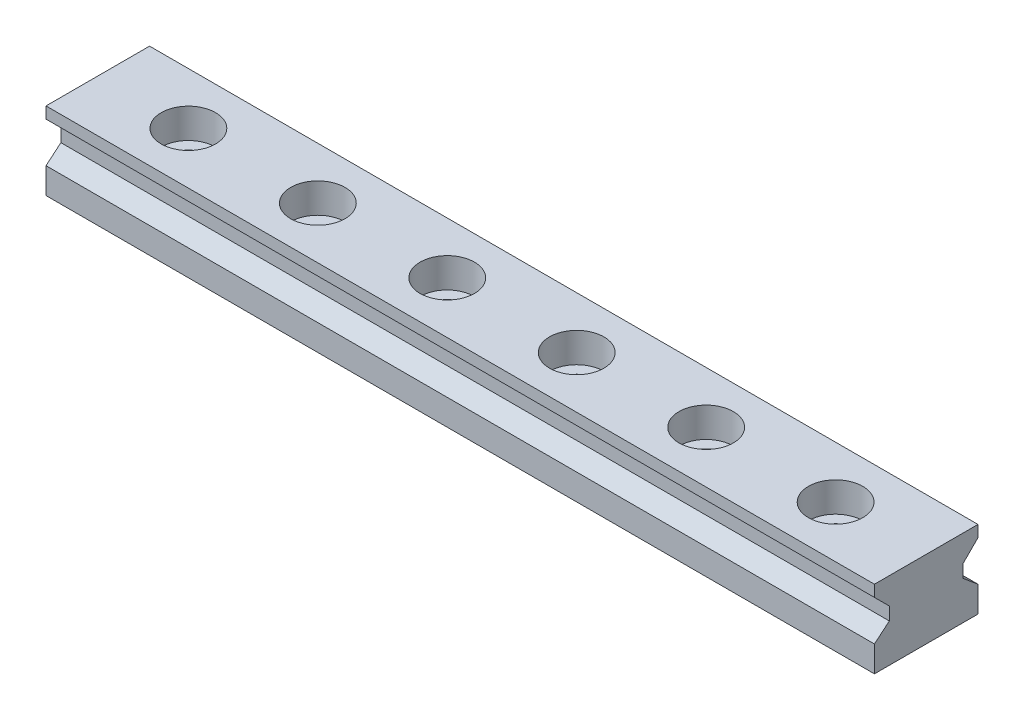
ISO-10303-21;
HEADER;
FILE_DESCRIPTION(('STEP AP214'),'2;1');
FILE_NAME('part.step','',(''),(''),'','','');
FILE_SCHEMA(('AUTOMOTIVE_DESIGN { 1 0 10303 214 1 1 1 1 }'));
ENDSEC;
DATA;
#1=APPLICATION_CONTEXT('core data for automotive mechanical design processes');
#2=APPLICATION_PROTOCOL_DEFINITION('international standard','automotive_design',2000,#1);
#3=PRODUCT_CONTEXT('',#1,'mechanical');
#4=PRODUCT('Part','Part','',(#3));
#5=PRODUCT_RELATED_PRODUCT_CATEGORY('part','',(#4));
#6=PRODUCT_DEFINITION_FORMATION('','',#4);
#7=PRODUCT_DEFINITION_CONTEXT('part definition',#1,'design');
#8=PRODUCT_DEFINITION('design','',#6,#7);
#9=PRODUCT_DEFINITION_SHAPE('','',#8);
#10=(LENGTH_UNIT() NAMED_UNIT(*) SI_UNIT(.MILLI.,.METRE.));
#11=(NAMED_UNIT(*) PLANE_ANGLE_UNIT() SI_UNIT($,.RADIAN.));
#12=(NAMED_UNIT(*) SI_UNIT($,.STERADIAN.) SOLID_ANGLE_UNIT());
#13=UNCERTAINTY_MEASURE_WITH_UNIT(LENGTH_MEASURE(1.E-05),#10,'distance_accuracy_value','');
#14=(GEOMETRIC_REPRESENTATION_CONTEXT(3) GLOBAL_UNCERTAINTY_ASSIGNED_CONTEXT((#13)) GLOBAL_UNIT_ASSIGNED_CONTEXT((#10,
#11,#12)) REPRESENTATION_CONTEXT('',''));
#15=CARTESIAN_POINT('',(0.,0.,0.));
#16=DIRECTION('',(0.,0.,1.));
#17=DIRECTION('',(1.,0.,0.));
#18=AXIS2_PLACEMENT_3D('',#15,#16,#17);
#19=CARTESIAN_POINT('',(-32.,5.114964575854,4.));
#20=DIRECTION('',(0.,-0.707106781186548,0.707106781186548));
#21=DIRECTION('',(0.,-0.707106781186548,-0.707106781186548));
#22=AXIS2_PLACEMENT_3D('',#19,#20,#21);
#23=PLANE('',#22);
#24=DIRECTION('',(1.,0.,0.));
#25=VECTOR('',#24,1.);
#26=CARTESIAN_POINT('',(-32.,5.114964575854,4.));
#27=LINE('',#26,#25);
#28=CARTESIAN_POINT('',(-32.,5.114964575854,4.));
#29=VERTEX_POINT('',#28);
#30=CARTESIAN_POINT('',(32.,5.114964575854,4.));
#31=VERTEX_POINT('',#30);
#32=EDGE_CURVE('E245',#29,#31,#27,.T.);
#33=ORIENTED_EDGE('',*,*,#32,.F.);
#34=DIRECTION('',(0.,-0.707106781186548,-0.707106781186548));
#35=VECTOR('',#34,1.);
#36=CARTESIAN_POINT('',(-32.,5.114964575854,4.));
#37=LINE('',#36,#35);
#38=CARTESIAN_POINT('',(-32.,3.964964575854,2.85));
#39=VERTEX_POINT('',#38);
#40=EDGE_CURVE('E117',#29,#39,#37,.T.);
#41=ORIENTED_EDGE('',*,*,#40,.T.);
#42=DIRECTION('',(1.,0.,0.));
#43=VECTOR('',#42,1.);
#44=CARTESIAN_POINT('',(-32.,3.964964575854,2.85));
#45=LINE('',#44,#43);
#46=CARTESIAN_POINT('',(32.,3.964964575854,2.85));
#47=VERTEX_POINT('',#46);
#48=EDGE_CURVE('E250',#47,#39,#45,.F.);
#49=ORIENTED_EDGE('',*,*,#48,.F.);
#50=DIRECTION('',(0.,-0.707106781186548,-0.707106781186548));
#51=VECTOR('',#50,1.);
#52=CARTESIAN_POINT('',(32.,5.114964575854,4.));
#53=LINE('',#52,#51);
#54=EDGE_CURVE('E136',#47,#31,#53,.F.);
#55=ORIENTED_EDGE('',*,*,#54,.T.);
#56=EDGE_LOOP('',(#33,#41,#49,#55));
#57=FACE_BOUND('',#56,.T.);
#58=ADVANCED_FACE('F16',(#57),#23,.T.);
#59=CARTESIAN_POINT('',(-32.,3.964964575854,-2.85));
#60=DIRECTION('',(0.,-0.707106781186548,-0.707106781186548));
#61=DIRECTION('',(0.,0.707106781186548,-0.707106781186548));
#62=AXIS2_PLACEMENT_3D('',#59,#60,#61);
#63=PLANE('',#62);
#64=DIRECTION('',(-1.,0.,0.));
#65=VECTOR('',#64,1.);
#66=CARTESIAN_POINT('',(-32.,3.964964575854,-2.85));
#67=LINE('',#66,#65);
#68=CARTESIAN_POINT('',(-32.,3.964964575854,-2.85));
#69=VERTEX_POINT('',#68);
#70=CARTESIAN_POINT('',(32.,3.964964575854,-2.85));
#71=VERTEX_POINT('',#70);
#72=EDGE_CURVE('E111',#69,#71,#67,.F.);
#73=ORIENTED_EDGE('',*,*,#72,.F.);
#74=DIRECTION('',(0.,0.707106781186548,-0.707106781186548));
#75=VECTOR('',#74,1.);
#76=CARTESIAN_POINT('',(-32.,3.964964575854,-2.85));
#77=LINE('',#76,#75);
#78=CARTESIAN_POINT('',(-32.,5.114964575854,-4.));
#79=VERTEX_POINT('',#78);
#80=EDGE_CURVE('E102',#69,#79,#77,.T.);
#81=ORIENTED_EDGE('',*,*,#80,.T.);
#82=DIRECTION('',(-1.,0.,0.));
#83=VECTOR('',#82,1.);
#84=CARTESIAN_POINT('',(-32.,5.114964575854,-4.));
#85=LINE('',#84,#83);
#86=CARTESIAN_POINT('',(32.,5.114964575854,-4.));
#87=VERTEX_POINT('',#86);
#88=EDGE_CURVE('E114',#87,#79,#85,.T.);
#89=ORIENTED_EDGE('',*,*,#88,.F.);
#90=DIRECTION('',(0.,0.707106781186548,-0.707106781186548));
#91=VECTOR('',#90,1.);
#92=CARTESIAN_POINT('',(32.,3.964964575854,-2.85));
#93=LINE('',#92,#91);
#94=EDGE_CURVE('E107',#87,#71,#93,.F.);
#95=ORIENTED_EDGE('',*,*,#94,.T.);
#96=EDGE_LOOP('',(#73,#81,#89,#95));
#97=FACE_BOUND('',#96,.T.);
#98=ADVANCED_FACE('F109',(#97),#63,.T.);
#99=CARTESIAN_POINT('',(-32.,2.964964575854,-2.85));
#100=DIRECTION('',(0.,0.,-1.));
#101=DIRECTION('',(-1.,0.,0.));
#102=AXIS2_PLACEMENT_3D('',#99,#100,#101);
#103=PLANE('',#102);
#104=DIRECTION('',(1.,0.,0.));
#105=VECTOR('',#104,1.);
#106=CARTESIAN_POINT('',(-32.,2.96496457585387,-2.84999999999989));
#107=LINE('',#106,#105);
#108=CARTESIAN_POINT('',(-32.,2.96496457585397,-2.84999999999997));
#109=VERTEX_POINT('',#108);
#110=CARTESIAN_POINT('',(32.,2.96496457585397,-2.84999999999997));
#111=VERTEX_POINT('',#110);
#112=EDGE_CURVE('E233',#109,#111,#107,.T.);
#113=ORIENTED_EDGE('',*,*,#112,.F.);
#114=DIRECTION('',(0.,1.,0.));
#115=VECTOR('',#114,1.);
#116=CARTESIAN_POINT('',(-32.,2.964964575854,-2.85));
#117=LINE('',#116,#115);
#118=EDGE_CURVE('E128',#109,#69,#117,.T.);
#119=ORIENTED_EDGE('',*,*,#118,.T.);
#120=ORIENTED_EDGE('',*,*,#72,.T.);
#121=DIRECTION('',(0.,1.,0.));
#122=VECTOR('',#121,1.);
#123=CARTESIAN_POINT('',(32.,2.964964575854,-2.85));
#124=LINE('',#123,#122);
#125=EDGE_CURVE('E120',#71,#111,#124,.F.);
#126=ORIENTED_EDGE('',*,*,#125,.T.);
#127=EDGE_LOOP('',(#113,#119,#120,#126));
#128=FACE_BOUND('',#127,.T.);
#129=ADVANCED_FACE('F130',(#128),#103,.T.);
#130=CARTESIAN_POINT('',(-32.,3.964964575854,2.85));
#131=DIRECTION('',(0.,0.,1.));
#132=DIRECTION('',(1.,0.,0.));
#133=AXIS2_PLACEMENT_3D('',#130,#131,#132);
#134=PLANE('',#133);
#135=ORIENTED_EDGE('',*,*,#48,.T.);
#136=DIRECTION('',(0.,1.,0.));
#137=VECTOR('',#136,1.);
#138=CARTESIAN_POINT('',(-32.,3.964964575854,2.85));
#139=LINE('',#138,#137);
#140=CARTESIAN_POINT('',(-32.,2.964964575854,2.85));
#141=VERTEX_POINT('',#140);
#142=EDGE_CURVE('E248',#39,#141,#139,.F.);
#143=ORIENTED_EDGE('',*,*,#142,.T.);
#144=DIRECTION('',(1.,0.,0.));
#145=VECTOR('',#144,1.);
#146=CARTESIAN_POINT('',(-32.,2.964964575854,2.85));
#147=LINE('',#146,#145);
#148=CARTESIAN_POINT('',(32.,2.964964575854,2.85));
#149=VERTEX_POINT('',#148);
#150=EDGE_CURVE('E226',#149,#141,#147,.F.);
#151=ORIENTED_EDGE('',*,*,#150,.F.);
#152=DIRECTION('',(0.,1.,0.));
#153=VECTOR('',#152,1.);
#154=CARTESIAN_POINT('',(32.,3.964964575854,2.85));
#155=LINE('',#154,#153);
#156=EDGE_CURVE('E253',#149,#47,#155,.T.);
#157=ORIENTED_EDGE('',*,*,#156,.T.);
#158=EDGE_LOOP('',(#135,#143,#151,#157));
#159=FACE_BOUND('',#158,.T.);
#160=ADVANCED_FACE('F257',(#159),#134,.T.);
#161=CARTESIAN_POINT('',(-32.,6.,4.));
#162=DIRECTION('',(0.,0.,1.));
#163=DIRECTION('',(1.,0.,0.));
#164=AXIS2_PLACEMENT_3D('',#161,#162,#163);
#165=PLANE('',#164);
#166=DIRECTION('',(1.,0.,0.));
#167=VECTOR('',#166,1.);
#168=CARTESIAN_POINT('',(-32.,6.,4.));
#169=LINE('',#168,#167);
#170=CARTESIAN_POINT('',(-32.,6.,4.));
#171=VERTEX_POINT('',#170);
#172=CARTESIAN_POINT('',(32.,6.,4.));
#173=VERTEX_POINT('',#172);
#174=EDGE_CURVE('E212',#171,#173,#169,.T.);
#175=ORIENTED_EDGE('',*,*,#174,.F.);
#176=DIRECTION('',(0.,1.,0.));
#177=VECTOR('',#176,1.);
#178=CARTESIAN_POINT('',(-32.,6.,4.));
#179=LINE('',#178,#177);
#180=EDGE_CURVE('E240',#171,#29,#179,.F.);
#181=ORIENTED_EDGE('',*,*,#180,.T.);
#182=ORIENTED_EDGE('',*,*,#32,.T.);
#183=DIRECTION('',(0.,1.,0.));
#184=VECTOR('',#183,1.);
#185=CARTESIAN_POINT('',(32.,6.,4.));
#186=LINE('',#185,#184);
#187=EDGE_CURVE('E243',#31,#173,#186,.T.);
#188=ORIENTED_EDGE('',*,*,#187,.T.);
#189=EDGE_LOOP('',(#175,#181,#182,#188));
#190=FACE_BOUND('',#189,.T.);
#191=ADVANCED_FACE('F370',(#190),#165,.T.);
#192=CARTESIAN_POINT('',(-32.,5.114964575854,-4.));
#193=DIRECTION('',(0.,0.,-1.));
#194=DIRECTION('',(-1.,0.,0.));
#195=AXIS2_PLACEMENT_3D('',#192,#193,#194);
#196=PLANE('',#195);
#197=ORIENTED_EDGE('',*,*,#88,.T.);
#198=DIRECTION('',(0.,1.,0.));
#199=VECTOR('',#198,1.);
#200=CARTESIAN_POINT('',(-32.,5.114964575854,-4.));
#201=LINE('',#200,#199);
#202=CARTESIAN_POINT('',(-32.,6.,-4.));
#203=VERTEX_POINT('',#202);
#204=EDGE_CURVE('E235',#79,#203,#201,.T.);
#205=ORIENTED_EDGE('',*,*,#204,.T.);
#206=DIRECTION('',(1.,0.,0.));
#207=VECTOR('',#206,1.);
#208=CARTESIAN_POINT('',(-32.,6.,-4.));
#209=LINE('',#208,#207);
#210=CARTESIAN_POINT('',(32.,6.,-4.));
#211=VERTEX_POINT('',#210);
#212=EDGE_CURVE('E208',#211,#203,#209,.F.);
#213=ORIENTED_EDGE('',*,*,#212,.F.);
#214=DIRECTION('',(0.,1.,0.));
#215=VECTOR('',#214,1.);
#216=CARTESIAN_POINT('',(32.,5.114964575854,-4.));
#217=LINE('',#216,#215);
#218=EDGE_CURVE('E238',#211,#87,#217,.F.);
#219=ORIENTED_EDGE('',*,*,#218,.T.);
#220=EDGE_LOOP('',(#197,#205,#213,#219));
#221=FACE_BOUND('',#220,.T.);
#222=ADVANCED_FACE('F361',(#221),#196,.T.);
#223=CARTESIAN_POINT('',(-25.,-0.3,0.));
#224=DIRECTION('',(0.,1.,0.));
#225=DIRECTION('',(0.,0.,1.));
#226=AXIS2_PLACEMENT_3D('',#223,#224,#225);
#227=CYLINDRICAL_SURFACE('',#226,2.1);
#228=CARTESIAN_POINT('',(-25.,3.7,0.));
#229=DIRECTION('',(0.,1.,0.));
#230=DIRECTION('',(0.,0.,1.));
#231=AXIS2_PLACEMENT_3D('',#228,#229,#230);
#232=CIRCLE('',#231,2.1);
#233=CARTESIAN_POINT('',(-25.,3.7,2.1));
#234=VERTEX_POINT('',#233);
#235=EDGE_CURVE('E189',#234,#234,#232,.T.);
#236=ORIENTED_EDGE('',*,*,#235,.F.);
#237=EDGE_LOOP('',(#236));
#238=FACE_BOUND('',#237,.T.);
#239=CARTESIAN_POINT('',(-25.,6.,0.));
#240=DIRECTION('',(0.,1.,0.));
#241=DIRECTION('',(0.,0.,1.));
#242=AXIS2_PLACEMENT_3D('',#239,#240,#241);
#243=CIRCLE('',#242,2.1);
#244=CARTESIAN_POINT('',(-25.,6.,2.1));
#245=VERTEX_POINT('',#244);
#246=EDGE_CURVE('E19',#245,#245,#243,.F.);
#247=ORIENTED_EDGE('',*,*,#246,.F.);
#248=EDGE_LOOP('',(#247));
#249=FACE_BOUND('',#248,.T.);
#250=ADVANCED_FACE('F357',(#238,#249),#227,.F.);
#251=CARTESIAN_POINT('',(-15.,-0.3,0.));
#252=DIRECTION('',(0.,1.,0.));
#253=DIRECTION('',(0.,0.,1.));
#254=AXIS2_PLACEMENT_3D('',#251,#252,#253);
#255=CYLINDRICAL_SURFACE('',#254,2.1);
#256=CARTESIAN_POINT('',(-15.,3.7,0.));
#257=DIRECTION('',(0.,1.,0.));
#258=DIRECTION('',(0.,0.,1.));
#259=AXIS2_PLACEMENT_3D('',#256,#257,#258);
#260=CIRCLE('',#259,2.1);
#261=CARTESIAN_POINT('',(-15.,3.7,2.1));
#262=VERTEX_POINT('',#261);
#263=EDGE_CURVE('E186',#262,#262,#260,.T.);
#264=ORIENTED_EDGE('',*,*,#263,.F.);
#265=EDGE_LOOP('',(#264));
#266=FACE_BOUND('',#265,.T.);
#267=CARTESIAN_POINT('',(-15.,6.,0.));
#268=DIRECTION('',(0.,1.,0.));
#269=DIRECTION('',(0.,0.,1.));
#270=AXIS2_PLACEMENT_3D('',#267,#268,#269);
#271=CIRCLE('',#270,2.1);
#272=CARTESIAN_POINT('',(-15.,6.,2.1));
#273=VERTEX_POINT('',#272);
#274=EDGE_CURVE('E203',#273,#273,#271,.F.);
#275=ORIENTED_EDGE('',*,*,#274,.F.);
#276=EDGE_LOOP('',(#275));
#277=FACE_BOUND('',#276,.T.);
#278=ADVANCED_FACE('F360',(#266,#277),#255,.F.);
#279=CARTESIAN_POINT('',(-5.,-0.3,0.));
#280=DIRECTION('',(0.,1.,0.));
#281=DIRECTION('',(0.,0.,1.));
#282=AXIS2_PLACEMENT_3D('',#279,#280,#281);
#283=CYLINDRICAL_SURFACE('',#282,2.1);
#284=CARTESIAN_POINT('',(-5.,3.7,0.));
#285=DIRECTION('',(0.,1.,0.));
#286=DIRECTION('',(0.,0.,1.));
#287=AXIS2_PLACEMENT_3D('',#284,#285,#286);
#288=CIRCLE('',#287,2.1);
#289=CARTESIAN_POINT('',(-5.,3.7,2.1));
#290=VERTEX_POINT('',#289);
#291=EDGE_CURVE('E183',#290,#290,#288,.T.);
#292=ORIENTED_EDGE('',*,*,#291,.F.);
#293=EDGE_LOOP('',(#292));
#294=FACE_BOUND('',#293,.T.);
#295=CARTESIAN_POINT('',(-5.,6.,0.));
#296=DIRECTION('',(0.,1.,0.));
#297=DIRECTION('',(0.,0.,1.));
#298=AXIS2_PLACEMENT_3D('',#295,#296,#297);
#299=CIRCLE('',#298,2.1);
#300=CARTESIAN_POINT('',(-5.,6.,2.1));
#301=VERTEX_POINT('',#300);
#302=EDGE_CURVE('E201',#301,#301,#299,.F.);
#303=ORIENTED_EDGE('',*,*,#302,.F.);
#304=EDGE_LOOP('',(#303));
#305=FACE_BOUND('',#304,.T.);
#306=ADVANCED_FACE('F367',(#294,#305),#283,.F.);
#307=CARTESIAN_POINT('',(5.,-0.3,0.));
#308=DIRECTION('',(0.,1.,0.));
#309=DIRECTION('',(0.,0.,1.));
#310=AXIS2_PLACEMENT_3D('',#307,#308,#309);
#311=CYLINDRICAL_SURFACE('',#310,2.1);
#312=CARTESIAN_POINT('',(5.,3.7,0.));
#313=DIRECTION('',(0.,1.,0.));
#314=DIRECTION('',(0.,0.,1.));
#315=AXIS2_PLACEMENT_3D('',#312,#313,#314);
#316=CIRCLE('',#315,2.1);
#317=CARTESIAN_POINT('',(5.,3.7,2.1));
#318=VERTEX_POINT('',#317);
#319=EDGE_CURVE('E180',#318,#318,#316,.T.);
#320=ORIENTED_EDGE('',*,*,#319,.F.);
#321=EDGE_LOOP('',(#320));
#322=FACE_BOUND('',#321,.T.);
#323=CARTESIAN_POINT('',(5.,6.,0.));
#324=DIRECTION('',(0.,1.,0.));
#325=DIRECTION('',(0.,0.,1.));
#326=AXIS2_PLACEMENT_3D('',#323,#324,#325);
#327=CIRCLE('',#326,2.1);
#328=CARTESIAN_POINT('',(5.,6.,2.1));
#329=VERTEX_POINT('',#328);
#330=EDGE_CURVE('E198',#329,#329,#327,.F.);
#331=ORIENTED_EDGE('',*,*,#330,.F.);
#332=EDGE_LOOP('',(#331));
#333=FACE_BOUND('',#332,.T.);
#334=ADVANCED_FACE('F439',(#322,#333),#311,.F.);
#335=CARTESIAN_POINT('',(15.,-0.3,0.));
#336=DIRECTION('',(0.,1.,0.));
#337=DIRECTION('',(0.,0.,1.));
#338=AXIS2_PLACEMENT_3D('',#335,#336,#337);
#339=CYLINDRICAL_SURFACE('',#338,2.1);
#340=CARTESIAN_POINT('',(15.,3.7,0.));
#341=DIRECTION('',(0.,1.,0.));
#342=DIRECTION('',(0.,0.,1.));
#343=AXIS2_PLACEMENT_3D('',#340,#341,#342);
#344=CIRCLE('',#343,2.1);
#345=CARTESIAN_POINT('',(15.,3.7,2.1));
#346=VERTEX_POINT('',#345);
#347=EDGE_CURVE('E177',#346,#346,#344,.T.);
#348=ORIENTED_EDGE('',*,*,#347,.F.);
#349=EDGE_LOOP('',(#348));
#350=FACE_BOUND('',#349,.T.);
#351=CARTESIAN_POINT('',(15.,6.,0.));
#352=DIRECTION('',(0.,1.,0.));
#353=DIRECTION('',(0.,0.,1.));
#354=AXIS2_PLACEMENT_3D('',#351,#352,#353);
#355=CIRCLE('',#354,2.1);
#356=CARTESIAN_POINT('',(15.,6.,2.1));
#357=VERTEX_POINT('',#356);
#358=EDGE_CURVE('E195',#357,#357,#355,.F.);
#359=ORIENTED_EDGE('',*,*,#358,.F.);
#360=EDGE_LOOP('',(#359));
#361=FACE_BOUND('',#360,.T.);
#362=ADVANCED_FACE('F448',(#350,#361),#339,.F.);
#363=CARTESIAN_POINT('',(25.,-0.3,0.));
#364=DIRECTION('',(0.,1.,0.));
#365=DIRECTION('',(0.,0.,1.));
#366=AXIS2_PLACEMENT_3D('',#363,#364,#365);
#367=CYLINDRICAL_SURFACE('',#366,2.1);
#368=CARTESIAN_POINT('',(25.,3.7,0.));
#369=DIRECTION('',(0.,1.,0.));
#370=DIRECTION('',(0.,0.,1.));
#371=AXIS2_PLACEMENT_3D('',#368,#369,#370);
#372=CIRCLE('',#371,2.1);
#373=CARTESIAN_POINT('',(25.,3.7,2.1));
#374=VERTEX_POINT('',#373);
#375=EDGE_CURVE('E173',#374,#374,#372,.T.);
#376=ORIENTED_EDGE('',*,*,#375,.F.);
#377=EDGE_LOOP('',(#376));
#378=FACE_BOUND('',#377,.T.);
#379=CARTESIAN_POINT('',(25.,6.,0.));
#380=DIRECTION('',(0.,1.,0.));
#381=DIRECTION('',(0.,0.,1.));
#382=AXIS2_PLACEMENT_3D('',#379,#380,#381);
#383=CIRCLE('',#382,2.1);
#384=CARTESIAN_POINT('',(25.,6.,2.1));
#385=VERTEX_POINT('',#384);
#386=EDGE_CURVE('E192',#385,#385,#383,.F.);
#387=ORIENTED_EDGE('',*,*,#386,.F.);
#388=EDGE_LOOP('',(#387));
#389=FACE_BOUND('',#388,.T.);
#390=ADVANCED_FACE('F458',(#378,#389),#367,.F.);
#391=CARTESIAN_POINT('',(-32.,2.,-4.));
#392=DIRECTION('',(0.,0.766044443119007,-0.642787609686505));
#393=DIRECTION('',(0.,0.642787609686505,0.766044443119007));
#394=AXIS2_PLACEMENT_3D('',#391,#392,#393);
#395=PLANE('',#394);
#396=DIRECTION('',(-1.,0.,0.));
#397=VECTOR('',#396,1.);
#398=CARTESIAN_POINT('',(-32.,2.,-4.));
#399=LINE('',#398,#397);
#400=CARTESIAN_POINT('',(-32.,2.,-4.));
#401=VERTEX_POINT('',#400);
#402=CARTESIAN_POINT('',(32.,2.,-4.));
#403=VERTEX_POINT('',#402);
#404=EDGE_CURVE('E176',#401,#403,#399,.F.);
#405=ORIENTED_EDGE('',*,*,#404,.F.);
#406=DIRECTION('',(0.,0.642787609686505,0.766044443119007));
#407=VECTOR('',#406,1.);
#408=CARTESIAN_POINT('',(-32.,2.,-4.));
#409=LINE('',#408,#407);
#410=EDGE_CURVE('E229',#401,#109,#409,.T.);
#411=ORIENTED_EDGE('',*,*,#410,.T.);
#412=ORIENTED_EDGE('',*,*,#112,.T.);
#413=DIRECTION('',(0.,0.642787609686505,0.766044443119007));
#414=VECTOR('',#413,1.);
#415=CARTESIAN_POINT('',(32.,2.,-4.));
#416=LINE('',#415,#414);
#417=EDGE_CURVE('E124',#111,#403,#416,.F.);
#418=ORIENTED_EDGE('',*,*,#417,.T.);
#419=EDGE_LOOP('',(#405,#411,#412,#418));
#420=FACE_BOUND('',#419,.T.);
#421=ADVANCED_FACE('F468',(#420),#395,.T.);
#422=CARTESIAN_POINT('',(-32.,2.964964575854,2.85));
#423=DIRECTION('',(0.,0.766044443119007,0.642787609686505));
#424=DIRECTION('',(0.,-0.642787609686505,0.766044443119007));
#425=AXIS2_PLACEMENT_3D('',#422,#423,#424);
#426=PLANE('',#425);
#427=ORIENTED_EDGE('',*,*,#150,.T.);
#428=DIRECTION('',(0.,-0.642787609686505,0.766044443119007));
#429=VECTOR('',#428,1.);
#430=CARTESIAN_POINT('',(-32.,2.964964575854,2.85));
#431=LINE('',#430,#429);
#432=CARTESIAN_POINT('',(-32.,2.00000000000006,4.00000000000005));
#433=VERTEX_POINT('',#432);
#434=EDGE_CURVE('E220',#141,#433,#431,.T.);
#435=ORIENTED_EDGE('',*,*,#434,.T.);
#436=DIRECTION('',(1.,0.,0.));
#437=VECTOR('',#436,1.);
#438=CARTESIAN_POINT('',(-32.,2.,4.));
#439=LINE('',#438,#437);
#440=CARTESIAN_POINT('',(32.,2.00000000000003,4.00000000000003));
#441=VERTEX_POINT('',#440);
#442=EDGE_CURVE('E270',#441,#433,#439,.F.);
#443=ORIENTED_EDGE('',*,*,#442,.F.);
#444=DIRECTION('',(0.,-0.64278760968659,0.766044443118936));
#445=VECTOR('',#444,1.);
#446=CARTESIAN_POINT('',(32.,2.964964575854,2.85));
#447=LINE('',#446,#445);
#448=EDGE_CURVE('E260',#149,#441,#447,.T.);
#449=ORIENTED_EDGE('',*,*,#448,.F.);
#450=EDGE_LOOP('',(#427,#435,#443,#449));
#451=FACE_BOUND('',#450,.T.);
#452=ADVANCED_FACE('F269',(#451),#426,.T.);
#453=CARTESIAN_POINT('',(-32.,6.,-4.));
#454=DIRECTION('',(0.,1.,0.));
#455=DIRECTION('',(0.,0.,1.));
#456=AXIS2_PLACEMENT_3D('',#453,#454,#455);
#457=PLANE('',#456);
#458=ORIENTED_EDGE('',*,*,#386,.T.);
#459=EDGE_LOOP('',(#458));
#460=FACE_BOUND('',#459,.T.);
#461=ORIENTED_EDGE('',*,*,#358,.T.);
#462=EDGE_LOOP('',(#461));
#463=FACE_BOUND('',#462,.T.);
#464=ORIENTED_EDGE('',*,*,#330,.T.);
#465=EDGE_LOOP('',(#464));
#466=FACE_BOUND('',#465,.T.);
#467=ORIENTED_EDGE('',*,*,#302,.T.);
#468=EDGE_LOOP('',(#467));
#469=FACE_BOUND('',#468,.T.);
#470=ORIENTED_EDGE('',*,*,#274,.T.);
#471=EDGE_LOOP('',(#470));
#472=FACE_BOUND('',#471,.T.);
#473=ORIENTED_EDGE('',*,*,#246,.T.);
#474=EDGE_LOOP('',(#473));
#475=FACE_BOUND('',#474,.T.);
#476=ORIENTED_EDGE('',*,*,#212,.T.);
#477=DIRECTION('',(0.,0.,-1.));
#478=VECTOR('',#477,1.);
#479=CARTESIAN_POINT('',(-32.,6.,0.));
#480=LINE('',#479,#478);
#481=EDGE_CURVE('E172',#203,#171,#480,.F.);
#482=ORIENTED_EDGE('',*,*,#481,.T.);
#483=ORIENTED_EDGE('',*,*,#174,.T.);
#484=DIRECTION('',(0.,0.,-1.));
#485=VECTOR('',#484,1.);
#486=CARTESIAN_POINT('',(32.,6.,0.));
#487=LINE('',#486,#485);
#488=EDGE_CURVE('E273',#211,#173,#487,.F.);
#489=ORIENTED_EDGE('',*,*,#488,.F.);
#490=EDGE_LOOP('',(#476,#482,#483,#489));
#491=FACE_BOUND('',#490,.T.);
#492=ADVANCED_FACE('F353',(#460,#463,#466,#469,#472,#475,#491),#457,.T.);
#493=CARTESIAN_POINT('',(-25.,3.7,0.));
#494=DIRECTION('',(0.,1.,0.));
#495=DIRECTION('',(0.,0.,1.));
#496=AXIS2_PLACEMENT_3D('',#493,#494,#495);
#497=PLANE('',#496);
#498=CARTESIAN_POINT('',(-25.,3.7,0.));
#499=DIRECTION('',(0.,1.,0.));
#500=DIRECTION('',(0.,0.,1.));
#501=AXIS2_PLACEMENT_3D('',#498,#499,#500);
#502=CIRCLE('',#501,1.2);
#503=CARTESIAN_POINT('',(-25.,3.7,1.2));
#504=VERTEX_POINT('',#503);
#505=EDGE_CURVE('E169',#504,#504,#502,.F.);
#506=ORIENTED_EDGE('',*,*,#505,.T.);
#507=EDGE_LOOP('',(#506));
#508=FACE_BOUND('',#507,.T.);
#509=ORIENTED_EDGE('',*,*,#235,.T.);
#510=EDGE_LOOP('',(#509));
#511=FACE_BOUND('',#510,.T.);
#512=ADVANCED_FACE('F349',(#508,#511),#497,.T.);
#513=CARTESIAN_POINT('',(-15.,3.7,0.));
#514=DIRECTION('',(0.,1.,0.));
#515=DIRECTION('',(0.,0.,1.));
#516=AXIS2_PLACEMENT_3D('',#513,#514,#515);
#517=PLANE('',#516);
#518=CARTESIAN_POINT('',(-15.,3.7,0.));
#519=DIRECTION('',(0.,1.,0.));
#520=DIRECTION('',(0.,0.,1.));
#521=AXIS2_PLACEMENT_3D('',#518,#519,#520);
#522=CIRCLE('',#521,1.2);
#523=CARTESIAN_POINT('',(-15.,3.7,1.2));
#524=VERTEX_POINT('',#523);
#525=EDGE_CURVE('E166',#524,#524,#522,.F.);
#526=ORIENTED_EDGE('',*,*,#525,.T.);
#527=EDGE_LOOP('',(#526));
#528=FACE_BOUND('',#527,.T.);
#529=ORIENTED_EDGE('',*,*,#263,.T.);
#530=EDGE_LOOP('',(#529));
#531=FACE_BOUND('',#530,.T.);
#532=ADVANCED_FACE('F352',(#528,#531),#517,.T.);
#533=CARTESIAN_POINT('',(-5.,3.7,0.));
#534=DIRECTION('',(0.,1.,0.));
#535=DIRECTION('',(0.,0.,1.));
#536=AXIS2_PLACEMENT_3D('',#533,#534,#535);
#537=PLANE('',#536);
#538=CARTESIAN_POINT('',(-5.,3.7,0.));
#539=DIRECTION('',(0.,1.,0.));
#540=DIRECTION('',(0.,0.,1.));
#541=AXIS2_PLACEMENT_3D('',#538,#539,#540);
#542=CIRCLE('',#541,1.2);
#543=CARTESIAN_POINT('',(-5.,3.7,1.2));
#544=VERTEX_POINT('',#543);
#545=EDGE_CURVE('E163',#544,#544,#542,.F.);
#546=ORIENTED_EDGE('',*,*,#545,.T.);
#547=EDGE_LOOP('',(#546));
#548=FACE_BOUND('',#547,.T.);
#549=ORIENTED_EDGE('',*,*,#291,.T.);
#550=EDGE_LOOP('',(#549));
#551=FACE_BOUND('',#550,.T.);
#552=ADVANCED_FACE('F510',(#548,#551),#537,.T.);
#553=CARTESIAN_POINT('',(5.,3.7,0.));
#554=DIRECTION('',(0.,1.,0.));
#555=DIRECTION('',(0.,0.,1.));
#556=AXIS2_PLACEMENT_3D('',#553,#554,#555);
#557=PLANE('',#556);
#558=CARTESIAN_POINT('',(5.,3.7,0.));
#559=DIRECTION('',(0.,1.,0.));
#560=DIRECTION('',(0.,0.,1.));
#561=AXIS2_PLACEMENT_3D('',#558,#559,#560);
#562=CIRCLE('',#561,1.2);
#563=CARTESIAN_POINT('',(5.,3.7,1.2));
#564=VERTEX_POINT('',#563);
#565=EDGE_CURVE('E160',#564,#564,#562,.F.);
#566=ORIENTED_EDGE('',*,*,#565,.T.);
#567=EDGE_LOOP('',(#566));
#568=FACE_BOUND('',#567,.T.);
#569=ORIENTED_EDGE('',*,*,#319,.T.);
#570=EDGE_LOOP('',(#569));
#571=FACE_BOUND('',#570,.T.);
#572=ADVANCED_FACE('F520',(#568,#571),#557,.T.);
#573=CARTESIAN_POINT('',(15.,3.7,0.));
#574=DIRECTION('',(0.,1.,0.));
#575=DIRECTION('',(0.,0.,1.));
#576=AXIS2_PLACEMENT_3D('',#573,#574,#575);
#577=PLANE('',#576);
#578=CARTESIAN_POINT('',(15.,3.7,0.));
#579=DIRECTION('',(0.,1.,0.));
#580=DIRECTION('',(0.,0.,1.));
#581=AXIS2_PLACEMENT_3D('',#578,#579,#580);
#582=CIRCLE('',#581,1.2);
#583=CARTESIAN_POINT('',(15.,3.7,1.2));
#584=VERTEX_POINT('',#583);
#585=EDGE_CURVE('E157',#584,#584,#582,.F.);
#586=ORIENTED_EDGE('',*,*,#585,.T.);
#587=EDGE_LOOP('',(#586));
#588=FACE_BOUND('',#587,.T.);
#589=ORIENTED_EDGE('',*,*,#347,.T.);
#590=EDGE_LOOP('',(#589));
#591=FACE_BOUND('',#590,.T.);
#592=ADVANCED_FACE('F530',(#588,#591),#577,.T.);
#593=CARTESIAN_POINT('',(25.,3.7,0.));
#594=DIRECTION('',(0.,1.,0.));
#595=DIRECTION('',(0.,0.,1.));
#596=AXIS2_PLACEMENT_3D('',#593,#594,#595);
#597=PLANE('',#596);
#598=CARTESIAN_POINT('',(25.,3.7,0.));
#599=DIRECTION('',(0.,1.,0.));
#600=DIRECTION('',(0.,0.,1.));
#601=AXIS2_PLACEMENT_3D('',#598,#599,#600);
#602=CIRCLE('',#601,1.2);
#603=CARTESIAN_POINT('',(25.,3.7,1.2));
#604=VERTEX_POINT('',#603);
#605=EDGE_CURVE('E153',#604,#604,#602,.F.);
#606=ORIENTED_EDGE('',*,*,#605,.T.);
#607=EDGE_LOOP('',(#606));
#608=FACE_BOUND('',#607,.T.);
#609=ORIENTED_EDGE('',*,*,#375,.T.);
#610=EDGE_LOOP('',(#609));
#611=FACE_BOUND('',#610,.T.);
#612=ADVANCED_FACE('F540',(#608,#611),#597,.T.);
#613=CARTESIAN_POINT('',(-32.,0.,-4.));
#614=DIRECTION('',(0.,0.,-1.));
#615=DIRECTION('',(-1.,0.,0.));
#616=AXIS2_PLACEMENT_3D('',#613,#614,#615);
#617=PLANE('',#616);
#618=DIRECTION('',(1.,0.,0.));
#619=VECTOR('',#618,1.);
#620=CARTESIAN_POINT('',(-32.,0.,-4.));
#621=LINE('',#620,#619);
#622=CARTESIAN_POINT('',(-32.,0.,-4.));
#623=VERTEX_POINT('',#622);
#624=CARTESIAN_POINT('',(32.,0.,-4.));
#625=VERTEX_POINT('',#624);
#626=EDGE_CURVE('E156',#623,#625,#621,.T.);
#627=ORIENTED_EDGE('',*,*,#626,.F.);
#628=DIRECTION('',(0.,1.,0.));
#629=VECTOR('',#628,1.);
#630=CARTESIAN_POINT('',(-32.,0.,-4.));
#631=LINE('',#630,#629);
#632=EDGE_CURVE('E282',#623,#401,#631,.T.);
#633=ORIENTED_EDGE('',*,*,#632,.T.);
#634=ORIENTED_EDGE('',*,*,#404,.T.);
#635=DIRECTION('',(0.,1.,0.));
#636=VECTOR('',#635,1.);
#637=CARTESIAN_POINT('',(32.,0.,-4.));
#638=LINE('',#637,#636);
#639=EDGE_CURVE('E272',#625,#403,#638,.T.);
#640=ORIENTED_EDGE('',*,*,#639,.F.);
#641=EDGE_LOOP('',(#627,#633,#634,#640));
#642=FACE_BOUND('',#641,.T.);
#643=ADVANCED_FACE('F300',(#642),#617,.T.);
#644=CARTESIAN_POINT('',(32.,0.,0.));
#645=DIRECTION('',(1.,0.,0.));
#646=DIRECTION('',(0.,0.,-1.));
#647=AXIS2_PLACEMENT_3D('',#644,#645,#646);
#648=PLANE('',#647);
#649=ORIENTED_EDGE('',*,*,#488,.T.);
#650=ORIENTED_EDGE('',*,*,#187,.F.);
#651=ORIENTED_EDGE('',*,*,#54,.F.);
#652=ORIENTED_EDGE('',*,*,#156,.F.);
#653=ORIENTED_EDGE('',*,*,#448,.T.);
#654=DIRECTION('',(0.,1.,0.));
#655=VECTOR('',#654,1.);
#656=CARTESIAN_POINT('',(32.,2.,4.));
#657=LINE('',#656,#655);
#658=CARTESIAN_POINT('',(32.,0.,4.));
#659=VERTEX_POINT('',#658);
#660=EDGE_CURVE('E278',#659,#441,#657,.T.);
#661=ORIENTED_EDGE('',*,*,#660,.F.);
#662=DIRECTION('',(0.,0.,-1.));
#663=VECTOR('',#662,1.);
#664=CARTESIAN_POINT('',(32.,0.,4.));
#665=LINE('',#664,#663);
#666=EDGE_CURVE('E288',#625,#659,#665,.F.);
#667=ORIENTED_EDGE('',*,*,#666,.F.);
#668=ORIENTED_EDGE('',*,*,#639,.T.);
#669=ORIENTED_EDGE('',*,*,#417,.F.);
#670=ORIENTED_EDGE('',*,*,#125,.F.);
#671=ORIENTED_EDGE('',*,*,#94,.F.);
#672=ORIENTED_EDGE('',*,*,#218,.F.);
#673=EDGE_LOOP('',(#649,#650,#651,#652,#653,#661,#667,#668,#669,#670,#671,#672));
#674=FACE_BOUND('',#673,.T.);
#675=ADVANCED_FACE('F122',(#674),#648,.T.);
#676=CARTESIAN_POINT('',(-32.,2.,4.));
#677=DIRECTION('',(0.,0.,1.));
#678=DIRECTION('',(1.,0.,0.));
#679=AXIS2_PLACEMENT_3D('',#676,#677,#678);
#680=PLANE('',#679);
#681=ORIENTED_EDGE('',*,*,#442,.T.);
#682=DIRECTION('',(0.,1.,0.));
#683=VECTOR('',#682,1.);
#684=CARTESIAN_POINT('',(-32.,0.,4.));
#685=LINE('',#684,#683);
#686=CARTESIAN_POINT('',(-32.,0.,4.));
#687=VERTEX_POINT('',#686);
#688=EDGE_CURVE('E34',#433,#687,#685,.F.);
#689=ORIENTED_EDGE('',*,*,#688,.T.);
#690=DIRECTION('',(1.,0.,0.));
#691=VECTOR('',#690,1.);
#692=CARTESIAN_POINT('',(-32.,0.,4.));
#693=LINE('',#692,#691);
#694=EDGE_CURVE('E291',#659,#687,#693,.F.);
#695=ORIENTED_EDGE('',*,*,#694,.F.);
#696=ORIENTED_EDGE('',*,*,#660,.T.);
#697=EDGE_LOOP('',(#681,#689,#695,#696));
#698=FACE_BOUND('',#697,.T.);
#699=ADVANCED_FACE('F302',(#698),#680,.T.);
#700=CARTESIAN_POINT('',(-32.,0.,0.));
#701=DIRECTION('',(1.,0.,0.));
#702=DIRECTION('',(0.,0.,-1.));
#703=AXIS2_PLACEMENT_3D('',#700,#701,#702);
#704=PLANE('',#703);
#705=ORIENTED_EDGE('',*,*,#204,.F.);
#706=ORIENTED_EDGE('',*,*,#80,.F.);
#707=ORIENTED_EDGE('',*,*,#118,.F.);
#708=ORIENTED_EDGE('',*,*,#410,.F.);
#709=ORIENTED_EDGE('',*,*,#632,.F.);
#710=DIRECTION('',(0.,0.,-1.));
#711=VECTOR('',#710,1.);
#712=CARTESIAN_POINT('',(-32.,0.,4.));
#713=LINE('',#712,#711);
#714=EDGE_CURVE('E152',#687,#623,#713,.T.);
#715=ORIENTED_EDGE('',*,*,#714,.F.);
#716=ORIENTED_EDGE('',*,*,#688,.F.);
#717=ORIENTED_EDGE('',*,*,#434,.F.);
#718=ORIENTED_EDGE('',*,*,#142,.F.);
#719=ORIENTED_EDGE('',*,*,#40,.F.);
#720=ORIENTED_EDGE('',*,*,#180,.F.);
#721=ORIENTED_EDGE('',*,*,#481,.F.);
#722=EDGE_LOOP('',(#705,#706,#707,#708,#709,#715,#716,#717,#718,#719,#720,#721));
#723=FACE_BOUND('',#722,.T.);
#724=ADVANCED_FACE('F267',(#723),#704,.F.);
#725=CARTESIAN_POINT('',(-25.,-0.3,0.));
#726=DIRECTION('',(0.,1.,0.));
#727=DIRECTION('',(0.,0.,1.));
#728=AXIS2_PLACEMENT_3D('',#725,#726,#727);
#729=CYLINDRICAL_SURFACE('',#728,1.2);
#730=ORIENTED_EDGE('',*,*,#505,.F.);
#731=EDGE_LOOP('',(#730));
#732=FACE_BOUND('',#731,.T.);
#733=CARTESIAN_POINT('',(-25.,0.,0.));
#734=DIRECTION('',(0.,1.,0.));
#735=DIRECTION('',(0.,0.,1.));
#736=AXIS2_PLACEMENT_3D('',#733,#734,#735);
#737=CIRCLE('',#736,1.2);
#738=CARTESIAN_POINT('',(-25.,0.,1.2));
#739=VERTEX_POINT('',#738);
#740=EDGE_CURVE('E149',#739,#739,#737,.T.);
#741=ORIENTED_EDGE('',*,*,#740,.F.);
#742=EDGE_LOOP('',(#741));
#743=FACE_BOUND('',#742,.T.);
#744=ADVANCED_FACE('F310',(#732,#743),#729,.F.);
#745=CARTESIAN_POINT('',(-15.,-0.3,0.));
#746=DIRECTION('',(0.,1.,0.));
#747=DIRECTION('',(0.,0.,1.));
#748=AXIS2_PLACEMENT_3D('',#745,#746,#747);
#749=CYLINDRICAL_SURFACE('',#748,1.2);
#750=ORIENTED_EDGE('',*,*,#525,.F.);
#751=EDGE_LOOP('',(#750));
#752=FACE_BOUND('',#751,.T.);
#753=CARTESIAN_POINT('',(-15.,0.,0.));
#754=DIRECTION('',(0.,1.,0.));
#755=DIRECTION('',(0.,0.,1.));
#756=AXIS2_PLACEMENT_3D('',#753,#754,#755);
#757=CIRCLE('',#756,1.2);
#758=CARTESIAN_POINT('',(-15.,0.,1.2));
#759=VERTEX_POINT('',#758);
#760=EDGE_CURVE('E146',#759,#759,#757,.T.);
#761=ORIENTED_EDGE('',*,*,#760,.F.);
#762=EDGE_LOOP('',(#761));
#763=FACE_BOUND('',#762,.T.);
#764=ADVANCED_FACE('F335',(#752,#763),#749,.F.);
#765=CARTESIAN_POINT('',(-5.,-0.3,0.));
#766=DIRECTION('',(0.,1.,0.));
#767=DIRECTION('',(0.,0.,1.));
#768=AXIS2_PLACEMENT_3D('',#765,#766,#767);
#769=CYLINDRICAL_SURFACE('',#768,1.2);
#770=ORIENTED_EDGE('',*,*,#545,.F.);
#771=EDGE_LOOP('',(#770));
#772=FACE_BOUND('',#771,.T.);
#773=CARTESIAN_POINT('',(-5.,0.,0.));
#774=DIRECTION('',(0.,1.,0.));
#775=DIRECTION('',(0.,0.,1.));
#776=AXIS2_PLACEMENT_3D('',#773,#774,#775);
#777=CIRCLE('',#776,1.2);
#778=CARTESIAN_POINT('',(-5.,0.,1.2));
#779=VERTEX_POINT('',#778);
#780=EDGE_CURVE('E143',#779,#779,#777,.T.);
#781=ORIENTED_EDGE('',*,*,#780,.F.);
#782=EDGE_LOOP('',(#781));
#783=FACE_BOUND('',#782,.T.);
#784=ADVANCED_FACE('F331',(#772,#783),#769,.F.);
#785=CARTESIAN_POINT('',(5.,-0.3,0.));
#786=DIRECTION('',(0.,1.,0.));
#787=DIRECTION('',(0.,0.,1.));
#788=AXIS2_PLACEMENT_3D('',#785,#786,#787);
#789=CYLINDRICAL_SURFACE('',#788,1.2);
#790=ORIENTED_EDGE('',*,*,#565,.F.);
#791=EDGE_LOOP('',(#790));
#792=FACE_BOUND('',#791,.T.);
#793=CARTESIAN_POINT('',(5.,0.,0.));
#794=DIRECTION('',(0.,1.,0.));
#795=DIRECTION('',(0.,0.,1.));
#796=AXIS2_PLACEMENT_3D('',#793,#794,#795);
#797=CIRCLE('',#796,1.2);
#798=CARTESIAN_POINT('',(5.,0.,1.2));
#799=VERTEX_POINT('',#798);
#800=EDGE_CURVE('E140',#799,#799,#797,.T.);
#801=ORIENTED_EDGE('',*,*,#800,.F.);
#802=EDGE_LOOP('',(#801));
#803=FACE_BOUND('',#802,.T.);
#804=ADVANCED_FACE('F327',(#792,#803),#789,.F.);
#805=CARTESIAN_POINT('',(15.,-0.3,0.));
#806=DIRECTION('',(0.,1.,0.));
#807=DIRECTION('',(0.,0.,1.));
#808=AXIS2_PLACEMENT_3D('',#805,#806,#807);
#809=CYLINDRICAL_SURFACE('',#808,1.2);
#810=ORIENTED_EDGE('',*,*,#585,.F.);
#811=EDGE_LOOP('',(#810));
#812=FACE_BOUND('',#811,.T.);
#813=CARTESIAN_POINT('',(15.,0.,0.));
#814=DIRECTION('',(0.,1.,0.));
#815=DIRECTION('',(0.,0.,1.));
#816=AXIS2_PLACEMENT_3D('',#813,#814,#815);
#817=CIRCLE('',#816,1.2);
#818=CARTESIAN_POINT('',(15.,0.,1.2));
#819=VERTEX_POINT('',#818);
#820=EDGE_CURVE('E25',#819,#819,#817,.T.);
#821=ORIENTED_EDGE('',*,*,#820,.F.);
#822=EDGE_LOOP('',(#821));
#823=FACE_BOUND('',#822,.T.);
#824=ADVANCED_FACE('F320',(#812,#823),#809,.F.);
#825=CARTESIAN_POINT('',(25.,-0.3,0.));
#826=DIRECTION('',(0.,1.,0.));
#827=DIRECTION('',(0.,0.,1.));
#828=AXIS2_PLACEMENT_3D('',#825,#826,#827);
#829=CYLINDRICAL_SURFACE('',#828,1.2);
#830=ORIENTED_EDGE('',*,*,#605,.F.);
#831=EDGE_LOOP('',(#830));
#832=FACE_BOUND('',#831,.T.);
#833=CARTESIAN_POINT('',(25.,0.,0.));
#834=DIRECTION('',(0.,1.,0.));
#835=DIRECTION('',(0.,0.,1.));
#836=AXIS2_PLACEMENT_3D('',#833,#834,#835);
#837=CIRCLE('',#836,1.2);
#838=CARTESIAN_POINT('',(25.,0.,1.2));
#839=VERTEX_POINT('',#838);
#840=EDGE_CURVE('E11',#839,#839,#837,.T.);
#841=ORIENTED_EDGE('',*,*,#840,.F.);
#842=EDGE_LOOP('',(#841));
#843=FACE_BOUND('',#842,.T.);
#844=ADVANCED_FACE('F314',(#832,#843),#829,.F.);
#845=CARTESIAN_POINT('',(-32.,0.,4.));
#846=DIRECTION('',(0.,-1.,0.));
#847=DIRECTION('',(0.,0.,-1.));
#848=AXIS2_PLACEMENT_3D('',#845,#846,#847);
#849=PLANE('',#848);
#850=ORIENTED_EDGE('',*,*,#840,.T.);
#851=EDGE_LOOP('',(#850));
#852=FACE_BOUND('',#851,.T.);
#853=ORIENTED_EDGE('',*,*,#820,.T.);
#854=EDGE_LOOP('',(#853));
#855=FACE_BOUND('',#854,.T.);
#856=ORIENTED_EDGE('',*,*,#800,.T.);
#857=EDGE_LOOP('',(#856));
#858=FACE_BOUND('',#857,.T.);
#859=ORIENTED_EDGE('',*,*,#780,.T.);
#860=EDGE_LOOP('',(#859));
#861=FACE_BOUND('',#860,.T.);
#862=ORIENTED_EDGE('',*,*,#760,.T.);
#863=EDGE_LOOP('',(#862));
#864=FACE_BOUND('',#863,.T.);
#865=ORIENTED_EDGE('',*,*,#740,.T.);
#866=EDGE_LOOP('',(#865));
#867=FACE_BOUND('',#866,.T.);
#868=ORIENTED_EDGE('',*,*,#694,.T.);
#869=ORIENTED_EDGE('',*,*,#714,.T.);
#870=ORIENTED_EDGE('',*,*,#626,.T.);
#871=ORIENTED_EDGE('',*,*,#666,.T.);
#872=EDGE_LOOP('',(#868,#869,#870,#871));
#873=FACE_BOUND('',#872,.T.);
#874=ADVANCED_FACE('F296',(#852,#855,#858,#861,#864,#867,#873),#849,.T.);
#875=CLOSED_SHELL('',(#58,#98,#129,#160,#191,#222,#250,#278,#306,#334,#362,#390,#421,#452,#492,
#512,#532,#552,#572,#592,#612,#643,#675,#699,#724,#744,#764,#784,#804,#824,#844,#874));
#876=MANIFOLD_SOLID_BREP('B1',#875);
#877=ADVANCED_BREP_SHAPE_REPRESENTATION('',(#18,#876),#14);
#878=SHAPE_DEFINITION_REPRESENTATION(#9,#877);
ENDSEC;
END-ISO-10303-21;
